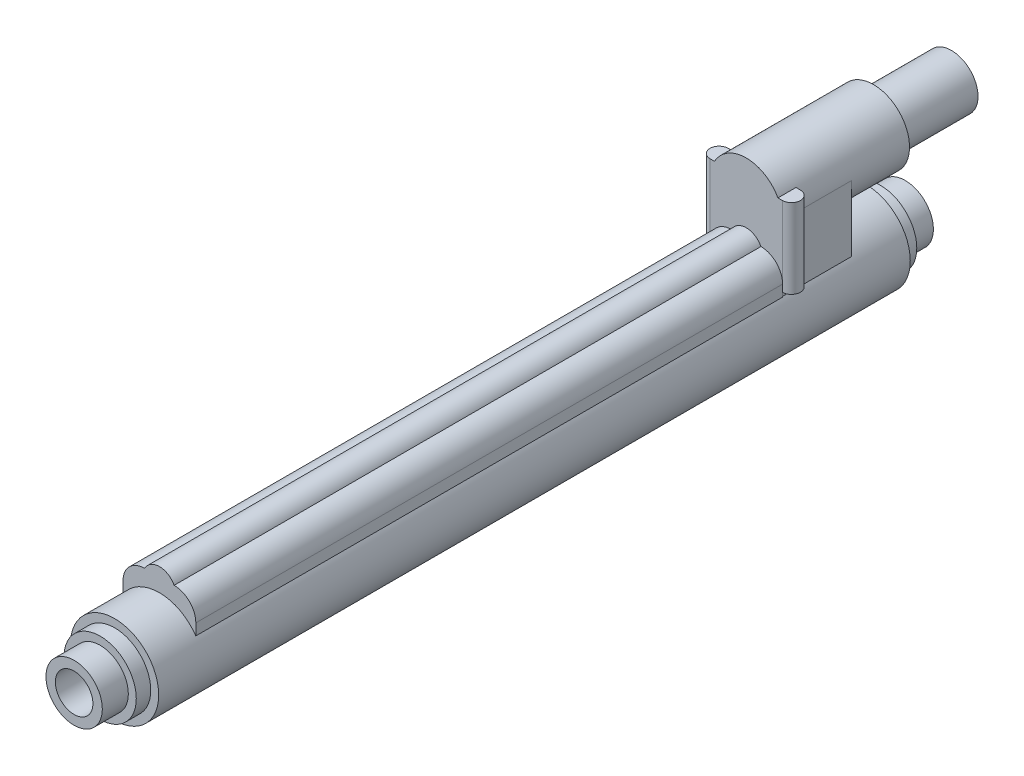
from build123d import *

# Parameters (mm, degrees)
SKETCH1_R            = 4.953
GLASS_DEPTH          = 146.05
SKETCH3_R            = 7.747
EPOXY_DEPTH          = 132.08
SKETCH4_R            = 6.35
RUBBER1_DEPTH        = 2.54
RUBBER2_START        = 2.54
SKETCH5_R            = 6.35
RUBBER2_DEPTH        = 2.54
SKETCH2_R            = 3.302
GLASS_HOLE_DEPTH     = 147.460351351
EPOXY_HEADER_DEPTH   = 12.192
EPOXY_BULGE_DEPTH    = 103.124
EPOXY_ROD_START      = 10.16
SKETCH9_R            = 6.35
EPOXY_ROD_DEPTH      = 10.16
SKETCH10_R           = 4.6736
METAL_FEEDTHRU_DEPTH = 13.716
EXTRUDE1_DEPTH       = 8.89
EXTRUDE1_DEPTH_BACK  = 5.08


with BuildPart() as part:
    # Sketch1 → glass (new body)
    with BuildSketch(Plane.XY):
        Circle(SKETCH1_R)
    extrude(amount=GLASS_DEPTH)

    # Sketch3 → epoxy (add)
    with BuildSketch(Plane.XY.offset(6.858)):
        Circle(SKETCH3_R)
    extrude(amount=EPOXY_DEPTH)

    # Sketch4 → rubber1 (add)
    with BuildSketch(Plane(origin=(0, 0, 6.858), x_dir=(-1, 0, 0), z_dir=(0, 0, -1))):
        with Locations(Location((0, 0, 0), (0, 0, 180))):
            Circle(SKETCH4_R)
    extrude(amount=RUBBER1_DEPTH)

    # Sketch5 → rubber2 (add)
    with BuildSketch(Plane.XY.offset(138.938).offset(RUBBER2_START)):
        Circle(SKETCH5_R)
    extrude(amount=-RUBBER2_DEPTH)

    # Sketch2 → glass_hole (cut, through all)
    with BuildSketch(Plane(origin=(0, 0, 0), x_dir=(-1, 0, 0), z_dir=(0, 0, -1))):
        Circle(SKETCH2_R)
    extrude(amount=-GLASS_HOLE_DEPTH, mode=Mode.SUBTRACT)

    # Sketch7 → epoxy_header (add)
    with BuildSketch(Plane.XY.offset(15.748)):
        with BuildLine():
            Line((6.35, 16.002), (6.35, 4.437736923))
            Line((6.35, 4.437736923), (-6.35, 4.437736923))
            Line((-6.35, 4.437736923), (-6.35, 16.002))
            ThreePointArc((-6.35, 16.002), (0, 22.352), (6.35, 16.002))
        make_face()
    extrude(amount=EPOXY_HEADER_DEPTH)

    # Sketch8 → epoxy_bulge (add)
    with BuildSketch(Plane.XY.offset(27.94)):
        with BuildLine():
            Line((6.400783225, 4.36417038), (6.400783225, 6.35))
            ThreePointArc((6.400783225, 6.35), (5.284860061, 9.044076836), (2.590783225, 10.16))
            ThreePointArc((2.590783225, 10.16), (0, 11.725198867), (-2.590783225, 10.16))
            ThreePointArc((-2.590783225, 10.16), (-5.284860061, 9.044076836), (-6.400783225, 6.35))
            Line((-6.400783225, 6.35), (-6.400783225, 4.36417038))
            Line((-6.400783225, 4.36417038), (6.400783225, 4.36417038))
        make_face()
    extrude(amount=EPOXY_BULGE_DEPTH)

    # Sketch9 → epoxy_rod (add)
    with BuildSketch(Plane(origin=(0, 0, 15.748), x_dir=(-1, 0, 0), z_dir=(0, 0, -1)).offset(EPOXY_ROD_START)):
        with Locations((0, 16.002)):
            Circle(SKETCH9_R)
    extrude(amount=-EPOXY_ROD_DEPTH)

    # Sketch10 → metal_feedthru (add)
    with BuildSketch(Plane(origin=(0, 0, 5.588), x_dir=(-1, 0, 0), z_dir=(0, 0, -1))):
        with Locations((0, 16.002)):
            Circle(SKETCH10_R)
    extrude(amount=METAL_FEEDTHRU_DEPTH)

    # Sketch11 → Extrude1 (add, two sides: drawn at the far end of the back side and taken through both)
    with BuildSketch(Plane(origin=(0, 10.16, 0), x_dir=(-1, 0, 0), z_dir=(0, 1, 0)).offset(-EXTRUDE1_DEPTH_BACK)):
        with BuildLine():
            Line((-6.35, 27.94), (6.35, 27.94))
            ThreePointArc((6.35, 27.94), (7.9375, 26.3525), (6.35, 24.765))
            Line((6.35, 24.765), (-6.35, 24.765))
            ThreePointArc((-6.35, 24.765), (-7.9375, 26.3525), (-6.35, 27.94))
        make_face()
    extrude(amount=EXTRUDE1_DEPTH + EXTRUDE1_DEPTH_BACK)


solid = part.part
